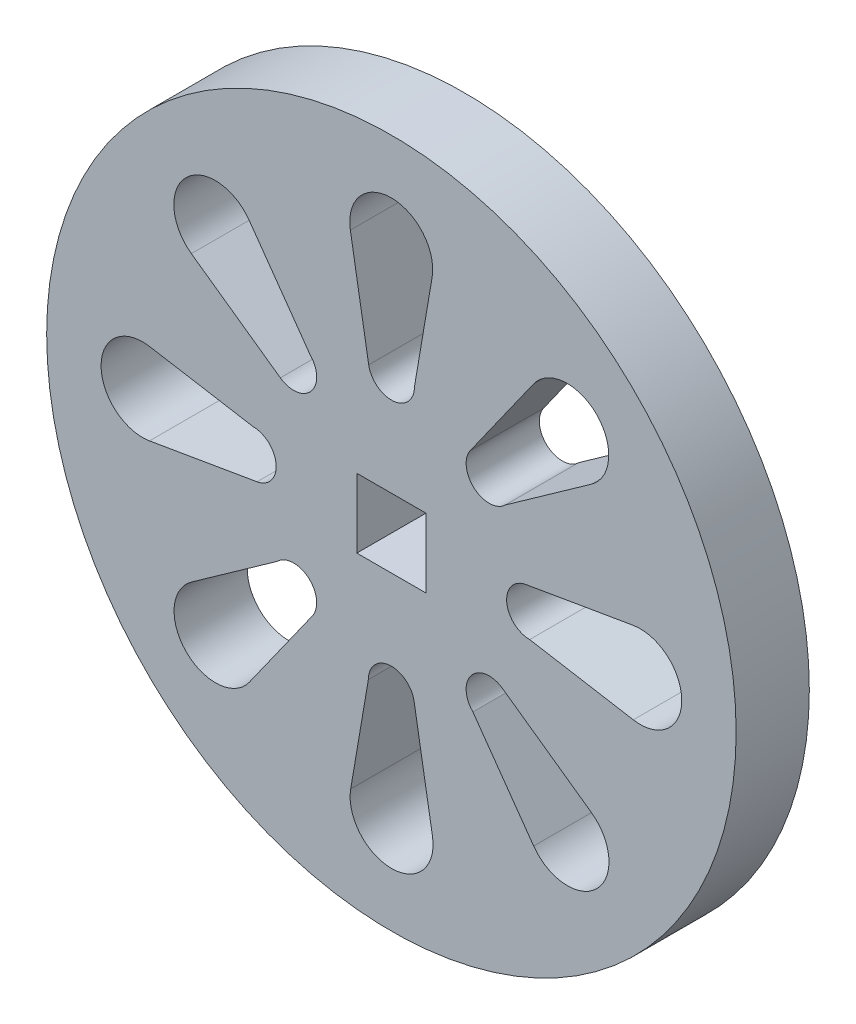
ISO-10303-21;
HEADER;
FILE_DESCRIPTION(('STEP AP214'),'2;1');
FILE_NAME('part.step','',(''),(''),'','','');
FILE_SCHEMA(('AUTOMOTIVE_DESIGN { 1 0 10303 214 1 1 1 1 }'));
ENDSEC;
DATA;
#1=APPLICATION_CONTEXT('core data for automotive mechanical design processes');
#2=APPLICATION_PROTOCOL_DEFINITION('international standard','automotive_design',2000,#1);
#3=PRODUCT_CONTEXT('',#1,'mechanical');
#4=PRODUCT('Part','Part','',(#3));
#5=PRODUCT_RELATED_PRODUCT_CATEGORY('part','',(#4));
#6=PRODUCT_DEFINITION_FORMATION('','',#4);
#7=PRODUCT_DEFINITION_CONTEXT('part definition',#1,'design');
#8=PRODUCT_DEFINITION('design','',#6,#7);
#9=PRODUCT_DEFINITION_SHAPE('','',#8);
#10=(LENGTH_UNIT() NAMED_UNIT(*) SI_UNIT(.MILLI.,.METRE.));
#11=(NAMED_UNIT(*) PLANE_ANGLE_UNIT() SI_UNIT($,.RADIAN.));
#12=(NAMED_UNIT(*) SI_UNIT($,.STERADIAN.) SOLID_ANGLE_UNIT());
#13=UNCERTAINTY_MEASURE_WITH_UNIT(LENGTH_MEASURE(1.E-05),#10,'distance_accuracy_value','');
#14=(GEOMETRIC_REPRESENTATION_CONTEXT(3) GLOBAL_UNCERTAINTY_ASSIGNED_CONTEXT((#13)) GLOBAL_UNIT_ASSIGNED_CONTEXT((#10,
#11,#12)) REPRESENTATION_CONTEXT('',''));
#15=CARTESIAN_POINT('',(0.,0.,0.));
#16=DIRECTION('',(0.,0.,1.));
#17=DIRECTION('',(1.,0.,0.));
#18=AXIS2_PLACEMENT_3D('',#15,#16,#17);
#19=CARTESIAN_POINT('',(0.,0.,10.0838));
#20=DIRECTION('',(0.,0.,-1.));
#21=DIRECTION('',(-1.,0.,0.));
#22=AXIS2_PLACEMENT_3D('',#19,#20,#21);
#23=CYLINDRICAL_SURFACE('',#22,47.5);
#24=CARTESIAN_POINT('',(0.,0.,10.0838));
#25=DIRECTION('',(0.,0.,1.));
#26=DIRECTION('',(1.,0.,0.));
#27=AXIS2_PLACEMENT_3D('',#24,#25,#26);
#28=CIRCLE('',#27,47.5);
#29=CARTESIAN_POINT('',(47.5,0.,10.0838));
#30=VERTEX_POINT('',#29);
#31=EDGE_CURVE('E12',#30,#30,#28,.T.);
#32=ORIENTED_EDGE('',*,*,#31,.F.);
#33=EDGE_LOOP('',(#32));
#34=FACE_BOUND('',#33,.T.);
#35=CARTESIAN_POINT('',(0.,0.,0.));
#36=DIRECTION('',(0.,0.,1.));
#37=DIRECTION('',(1.,0.,0.));
#38=AXIS2_PLACEMENT_3D('',#35,#36,#37);
#39=CIRCLE('',#38,47.5);
#40=CARTESIAN_POINT('',(47.5,0.,0.));
#41=VERTEX_POINT('',#40);
#42=EDGE_CURVE('E47',#41,#41,#39,.T.);
#43=ORIENTED_EDGE('',*,*,#42,.T.);
#44=EDGE_LOOP('',(#43));
#45=FACE_BOUND('',#44,.T.);
#46=ADVANCED_FACE('F44',(#34,#45),#23,.T.);
#47=CARTESIAN_POINT('',(0.,0.,10.0838));
#48=DIRECTION('',(0.,0.,1.));
#49=DIRECTION('',(1.,0.,0.));
#50=AXIS2_PLACEMENT_3D('',#47,#48,#49);
#51=PLANE('',#50);
#52=CARTESIAN_POINT('',(-34.289982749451,-0.0229302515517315,10.0838));
#53=DIRECTION('',(0.,0.,1.));
#54=DIRECTION('',(0.,-1.,0.));
#55=AXIS2_PLACEMENT_3D('',#52,#53,#54);
#56=CIRCLE('',#55,5.715);
#57=CARTESIAN_POINT('',(-33.3290052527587,5.61069622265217,10.0838));
#58=VERTEX_POINT('',#57);
#59=CARTESIAN_POINT('',(-33.3290052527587,-5.65655672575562,10.0838));
#60=VERTEX_POINT('',#59);
#61=EDGE_CURVE('E58',#58,#60,#56,.T.);
#62=ORIENTED_EDGE('',*,*,#61,.F.);
#63=DIRECTION('',(-0.985761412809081,0.168150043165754,0.));
#64=VECTOR('',#63,1.);
#65=CARTESIAN_POINT('',(-19.05,3.17499999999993,10.0838));
#66=LINE('',#65,#64);
#67=CARTESIAN_POINT('',(-19.05,3.17499999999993,10.0838));
#68=VERTEX_POINT('',#67);
#69=EDGE_CURVE('E1071',#68,#58,#66,.T.);
#70=ORIENTED_EDGE('',*,*,#69,.F.);
#71=CARTESIAN_POINT('',(-19.05,0.,10.0838));
#72=DIRECTION('',(0.,0.,1.));
#73=DIRECTION('',(0.,1.,0.));
#74=AXIS2_PLACEMENT_3D('',#71,#72,#73);
#75=CIRCLE('',#74,3.175);
#76=CARTESIAN_POINT('',(-18.5161236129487,-3.12979248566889,10.0838));
#77=VERTEX_POINT('',#76);
#78=EDGE_CURVE('E1114',#77,#68,#75,.T.);
#79=ORIENTED_EDGE('',*,*,#78,.F.);
#80=DIRECTION('',(0.98576141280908,0.168150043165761,0.));
#81=VECTOR('',#80,1.);
#82=CARTESIAN_POINT('',(-18.5161236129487,-3.1297924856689,10.0838));
#83=LINE('',#82,#81);
#84=EDGE_CURVE('E421',#60,#77,#83,.T.);
#85=ORIENTED_EDGE('',*,*,#84,.F.);
#86=EDGE_LOOP('',(#62,#70,#79,#85));
#87=FACE_BOUND('',#86,.T.);
#88=CARTESIAN_POINT('',(-24.2304651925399,-24.2628934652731,10.0838));
#89=DIRECTION('',(0.,0.,1.));
#90=DIRECTION('',(0.707106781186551,-0.707106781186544,0.));
#91=AXIS2_PLACEMENT_3D('',#88,#89,#90);
#92=CIRCLE('',#91,5.715);
#93=CARTESIAN_POINT('',(-27.5345269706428,-19.5998042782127,10.0838));
#94=VERTEX_POINT('',#93);
#95=CARTESIAN_POINT('',(-19.5673760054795,-27.5669552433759,10.0838));
#96=VERTEX_POINT('',#95);
#97=EDGE_CURVE('E66',#94,#96,#92,.T.);
#98=ORIENTED_EDGE('',*,*,#97,.F.);
#99=DIRECTION('',(-0.815938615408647,-0.578138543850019,0.));
#100=VECTOR('',#99,1.);
#101=CARTESIAN_POINT('',(-15.715448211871,-11.2253201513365,10.0838));
#102=LINE('',#101,#100);
#103=CARTESIAN_POINT('',(-15.715448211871,-11.2253201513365,10.0838));
#104=VERTEX_POINT('',#103);
#105=EDGE_CURVE('E1308',#104,#94,#102,.T.);
#106=ORIENTED_EDGE('',*,*,#105,.F.);
#107=CARTESIAN_POINT('',(-13.4703841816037,-13.4703841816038,10.0838));
#108=DIRECTION('',(0.,0.,1.));
#109=DIRECTION('',(-0.707106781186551,0.707106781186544,0.));
#110=AXIS2_PLACEMENT_3D('',#107,#108,#109);
#111=CIRCLE('',#110,3.175);
#112=CARTESIAN_POINT('',(-10.8797790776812,-15.3059740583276,10.0838));
#113=VERTEX_POINT('',#112);
#114=EDGE_CURVE('E399',#113,#104,#111,.T.);
#115=ORIENTED_EDGE('',*,*,#114,.F.);
#116=DIRECTION('',(0.57813854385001,0.815938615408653,0.));
#117=VECTOR('',#116,1.);
#118=CARTESIAN_POINT('',(-10.8797790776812,-15.3059740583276,10.0838));
#119=LINE('',#118,#117);
#120=EDGE_CURVE('E1247',#96,#113,#119,.T.);
#121=ORIENTED_EDGE('',*,*,#120,.F.);
#122=EDGE_LOOP('',(#98,#106,#115,#121));
#123=FACE_BOUND('',#122,.T.);
#124=CARTESIAN_POINT('',(0.0229302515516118,-34.289982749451,10.0838));
#125=DIRECTION('',(0.,0.,1.));
#126=DIRECTION('',(1.,0.,0.));
#127=AXIS2_PLACEMENT_3D('',#124,#125,#126);
#128=CIRCLE('',#127,5.715);
#129=CARTESIAN_POINT('',(-5.61069622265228,-33.3290052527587,10.0838));
#130=VERTEX_POINT('',#129);
#131=CARTESIAN_POINT('',(5.65655672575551,-33.3290052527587,10.0838));
#132=VERTEX_POINT('',#131);
#133=EDGE_CURVE('E1248',#130,#132,#128,.T.);
#134=ORIENTED_EDGE('',*,*,#133,.F.);
#135=DIRECTION('',(-0.168150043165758,-0.98576141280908,0.));
#136=VECTOR('',#135,1.);
#137=CARTESIAN_POINT('',(-3.175,-19.05,10.0838));
#138=LINE('',#137,#136);
#139=CARTESIAN_POINT('',(-3.175,-19.05,10.0838));
#140=VERTEX_POINT('',#139);
#141=EDGE_CURVE('E440',#140,#130,#138,.T.);
#142=ORIENTED_EDGE('',*,*,#141,.F.);
#143=CARTESIAN_POINT('',(0.,-19.05,10.0838));
#144=DIRECTION('',(0.,0.,1.));
#145=DIRECTION('',(-1.,0.,0.));
#146=AXIS2_PLACEMENT_3D('',#143,#144,#145);
#147=CIRCLE('',#146,3.175);
#148=CARTESIAN_POINT('',(3.12979248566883,-18.5161236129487,10.0838));
#149=VERTEX_POINT('',#148);
#150=EDGE_CURVE('E465',#149,#140,#147,.T.);
#151=ORIENTED_EDGE('',*,*,#150,.F.);
#152=DIRECTION('',(-0.168150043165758,0.98576141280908,0.));
#153=VECTOR('',#152,1.);
#154=CARTESIAN_POINT('',(3.12979248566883,-18.5161236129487,10.0838));
#155=LINE('',#154,#153);
#156=EDGE_CURVE('E424',#132,#149,#155,.T.);
#157=ORIENTED_EDGE('',*,*,#156,.F.);
#158=EDGE_LOOP('',(#134,#142,#151,#157));
#159=FACE_BOUND('',#158,.T.);
#160=CARTESIAN_POINT('',(24.2628934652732,-24.2304651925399,10.0838));
#161=DIRECTION('',(0.,0.,1.));
#162=DIRECTION('',(0.707106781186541,0.707106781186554,0.));
#163=AXIS2_PLACEMENT_3D('',#160,#161,#162);
#164=CIRCLE('',#163,5.715);
#165=CARTESIAN_POINT('',(19.5998042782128,-27.5345269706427,10.0838));
#166=VERTEX_POINT('',#165);
#167=CARTESIAN_POINT('',(27.566955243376,-19.5673760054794,10.0838));
#168=VERTEX_POINT('',#167);
#169=EDGE_CURVE('E1217',#166,#168,#164,.T.);
#170=ORIENTED_EDGE('',*,*,#169,.F.);
#171=DIRECTION('',(0.578138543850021,-0.815938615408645,0.));
#172=VECTOR('',#171,1.);
#173=CARTESIAN_POINT('',(11.2253201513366,-15.7154482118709,10.0838));
#174=LINE('',#173,#172);
#175=CARTESIAN_POINT('',(11.2253201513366,-15.7154482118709,10.0838));
#176=VERTEX_POINT('',#175);
#177=EDGE_CURVE('E1212',#176,#166,#174,.T.);
#178=ORIENTED_EDGE('',*,*,#177,.F.);
#179=CARTESIAN_POINT('',(13.4703841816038,-13.4703841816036,10.0838));
#180=DIRECTION('',(0.,0.,1.));
#181=DIRECTION('',(-0.707106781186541,-0.707106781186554,0.));
#182=AXIS2_PLACEMENT_3D('',#179,#180,#181);
#183=CIRCLE('',#182,3.175);
#184=CARTESIAN_POINT('',(15.3059740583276,-10.8797790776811,10.0838));
#185=VERTEX_POINT('',#184);
#186=EDGE_CURVE('E1201',#185,#176,#183,.T.);
#187=ORIENTED_EDGE('',*,*,#186,.F.);
#188=DIRECTION('',(-0.815938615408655,0.578138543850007,0.));
#189=VECTOR('',#188,1.);
#190=CARTESIAN_POINT('',(15.3059740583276,-10.8797790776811,10.0838));
#191=LINE('',#190,#189);
#192=EDGE_CURVE('E332',#168,#185,#191,.T.);
#193=ORIENTED_EDGE('',*,*,#192,.F.);
#194=EDGE_LOOP('',(#170,#178,#187,#193));
#195=FACE_BOUND('',#194,.T.);
#196=CARTESIAN_POINT('',(34.289982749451,0.0229302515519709,10.0838));
#197=DIRECTION('',(0.,0.,1.));
#198=DIRECTION('',(0.,1.,0.));
#199=AXIS2_PLACEMENT_3D('',#196,#197,#198);
#200=CIRCLE('',#199,5.715);
#201=CARTESIAN_POINT('',(33.3290052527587,-5.61069622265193,10.0838));
#202=VERTEX_POINT('',#201);
#203=CARTESIAN_POINT('',(33.3290052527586,5.65655672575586,10.0838));
#204=VERTEX_POINT('',#203);
#205=EDGE_CURVE('E321',#202,#204,#200,.T.);
#206=ORIENTED_EDGE('',*,*,#205,.F.);
#207=DIRECTION('',(0.985761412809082,-0.168150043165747,0.));
#208=VECTOR('',#207,1.);
#209=CARTESIAN_POINT('',(19.05,-3.1749999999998,10.0838));
#210=LINE('',#209,#208);
#211=CARTESIAN_POINT('',(19.05,-3.1749999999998,10.0838));
#212=VERTEX_POINT('',#211);
#213=EDGE_CURVE('E304',#212,#202,#210,.T.);
#214=ORIENTED_EDGE('',*,*,#213,.F.);
#215=CARTESIAN_POINT('',(19.05,1.99538158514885E-13,10.0838));
#216=DIRECTION('',(0.,0.,1.));
#217=DIRECTION('',(0.,-1.,0.));
#218=AXIS2_PLACEMENT_3D('',#215,#216,#217);
#219=CIRCLE('',#218,3.175);
#220=CARTESIAN_POINT('',(18.5161236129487,3.12979248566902,10.0838));
#221=VERTEX_POINT('',#220);
#222=EDGE_CURVE('E296',#221,#212,#219,.T.);
#223=ORIENTED_EDGE('',*,*,#222,.F.);
#224=DIRECTION('',(-0.985761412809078,-0.168150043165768,0.));
#225=VECTOR('',#224,1.);
#226=CARTESIAN_POINT('',(18.5161236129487,3.12979248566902,10.0838));
#227=LINE('',#226,#225);
#228=EDGE_CURVE('E281',#204,#221,#227,.T.);
#229=ORIENTED_EDGE('',*,*,#228,.F.);
#230=EDGE_LOOP('',(#206,#214,#223,#229));
#231=FACE_BOUND('',#230,.T.);
#232=CARTESIAN_POINT('',(24.2304651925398,24.2628934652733,10.0838));
#233=DIRECTION('',(0.,0.,1.));
#234=DIRECTION('',(-0.707106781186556,0.707106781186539,0.));
#235=AXIS2_PLACEMENT_3D('',#232,#233,#234);
#236=CIRCLE('',#235,5.715);
#237=CARTESIAN_POINT('',(27.5345269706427,19.5998042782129,10.0838));
#238=VERTEX_POINT('',#237);
#239=CARTESIAN_POINT('',(19.5673760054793,27.5669552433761,10.0838));
#240=VERTEX_POINT('',#239);
#241=EDGE_CURVE('E1142',#238,#240,#236,.T.);
#242=ORIENTED_EDGE('',*,*,#241,.F.);
#243=DIRECTION('',(0.815938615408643,0.578138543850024,0.));
#244=VECTOR('',#243,1.);
#245=CARTESIAN_POINT('',(15.7154482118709,11.2253201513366,10.0838));
#246=LINE('',#245,#244);
#247=CARTESIAN_POINT('',(15.7154482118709,11.2253201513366,10.0838));
#248=VERTEX_POINT('',#247);
#249=EDGE_CURVE('E1147',#248,#238,#246,.T.);
#250=ORIENTED_EDGE('',*,*,#249,.F.);
#251=CARTESIAN_POINT('',(13.4703841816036,13.4703841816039,10.0838));
#252=DIRECTION('',(0.,0.,1.));
#253=DIRECTION('',(0.707106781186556,-0.707106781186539,0.));
#254=AXIS2_PLACEMENT_3D('',#251,#252,#253);
#255=CIRCLE('',#254,3.175);
#256=CARTESIAN_POINT('',(10.8797790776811,15.3059740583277,10.0838));
#257=VERTEX_POINT('',#256);
#258=EDGE_CURVE('E1171',#257,#248,#255,.T.);
#259=ORIENTED_EDGE('',*,*,#258,.F.);
#260=DIRECTION('',(-0.578138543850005,-0.815938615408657,0.));
#261=VECTOR('',#260,1.);
#262=CARTESIAN_POINT('',(10.8797790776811,15.3059740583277,10.0838));
#263=LINE('',#262,#261);
#264=EDGE_CURVE('E333',#240,#257,#263,.T.);
#265=ORIENTED_EDGE('',*,*,#264,.F.);
#266=EDGE_LOOP('',(#242,#250,#259,#265));
#267=FACE_BOUND('',#266,.T.);
#268=CARTESIAN_POINT('',(-24.262893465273,24.23046519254,10.0838));
#269=DIRECTION('',(0.,0.,1.));
#270=DIRECTION('',(-0.707106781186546,-0.707106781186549,0.));
#271=AXIS2_PLACEMENT_3D('',#268,#269,#270);
#272=CIRCLE('',#271,5.715);
#273=CARTESIAN_POINT('',(-19.5998042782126,27.5345269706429,10.0838));
#274=VERTEX_POINT('',#273);
#275=CARTESIAN_POINT('',(-27.5669552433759,19.5673760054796,10.0838));
#276=VERTEX_POINT('',#275);
#277=EDGE_CURVE('E480',#274,#276,#272,.T.);
#278=ORIENTED_EDGE('',*,*,#277,.F.);
#279=DIRECTION('',(-0.578138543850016,0.815938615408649,0.));
#280=VECTOR('',#279,1.);
#281=CARTESIAN_POINT('',(-11.2253201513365,15.715448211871,10.0838));
#282=LINE('',#281,#280);
#283=CARTESIAN_POINT('',(-11.2253201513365,15.715448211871,10.0838));
#284=VERTEX_POINT('',#283);
#285=EDGE_CURVE('E526',#284,#274,#282,.T.);
#286=ORIENTED_EDGE('',*,*,#285,.F.);
#287=CARTESIAN_POINT('',(-13.4703841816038,13.4703841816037,10.0838));
#288=DIRECTION('',(0.,0.,1.));
#289=DIRECTION('',(0.707106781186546,0.707106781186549,0.));
#290=AXIS2_PLACEMENT_3D('',#287,#288,#289);
#291=CIRCLE('',#290,3.175);
#292=CARTESIAN_POINT('',(-15.3059740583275,10.8797790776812,10.0838));
#293=VERTEX_POINT('',#292);
#294=EDGE_CURVE('E514',#293,#284,#291,.T.);
#295=ORIENTED_EDGE('',*,*,#294,.F.);
#296=DIRECTION('',(0.815938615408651,-0.578138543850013,0.));
#297=VECTOR('',#296,1.);
#298=CARTESIAN_POINT('',(-15.3059740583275,10.8797790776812,10.0838));
#299=LINE('',#298,#297);
#300=EDGE_CURVE('E497',#276,#293,#299,.T.);
#301=ORIENTED_EDGE('',*,*,#300,.F.);
#302=EDGE_LOOP('',(#278,#286,#295,#301));
#303=FACE_BOUND('',#302,.T.);
#304=CARTESIAN_POINT('',(-0.0229302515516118,34.289982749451,10.0838));
#305=DIRECTION('',(0.,0.,1.));
#306=DIRECTION('',(-1.,0.,0.));
#307=AXIS2_PLACEMENT_3D('',#304,#305,#306);
#308=CIRCLE('',#307,5.715);
#309=CARTESIAN_POINT('',(5.61069622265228,33.3290052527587,10.0838));
#310=VERTEX_POINT('',#309);
#311=CARTESIAN_POINT('',(-5.65655672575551,33.3290052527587,10.0838));
#312=VERTEX_POINT('',#311);
#313=EDGE_CURVE('E550',#310,#312,#308,.T.);
#314=ORIENTED_EDGE('',*,*,#313,.F.);
#315=DIRECTION('',(0.168150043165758,0.98576141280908,0.));
#316=VECTOR('',#315,1.);
#317=CARTESIAN_POINT('',(3.175,19.05,10.0838));
#318=LINE('',#317,#316);
#319=CARTESIAN_POINT('',(3.175,19.05,10.0838));
#320=VERTEX_POINT('',#319);
#321=EDGE_CURVE('E378',#320,#310,#318,.T.);
#322=ORIENTED_EDGE('',*,*,#321,.F.);
#323=CARTESIAN_POINT('',(0.,19.05,10.0838));
#324=DIRECTION('',(0.,0.,1.));
#325=DIRECTION('',(1.,0.,0.));
#326=AXIS2_PLACEMENT_3D('',#323,#324,#325);
#327=CIRCLE('',#326,3.175);
#328=CARTESIAN_POINT('',(-3.12979248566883,18.5161236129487,10.0838));
#329=VERTEX_POINT('',#328);
#330=EDGE_CURVE('E557',#329,#320,#327,.T.);
#331=ORIENTED_EDGE('',*,*,#330,.F.);
#332=DIRECTION('',(0.168150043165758,-0.98576141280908,0.));
#333=VECTOR('',#332,1.);
#334=CARTESIAN_POINT('',(-3.12979248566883,18.5161236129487,10.0838));
#335=LINE('',#334,#333);
#336=EDGE_CURVE('E551',#312,#329,#335,.T.);
#337=ORIENTED_EDGE('',*,*,#336,.F.);
#338=EDGE_LOOP('',(#314,#322,#331,#337));
#339=FACE_BOUND('',#338,.T.);
#340=DIRECTION('',(0.,1.,0.));
#341=VECTOR('',#340,1.);
#342=CARTESIAN_POINT('',(4.7625,4.7625,10.0838));
#343=LINE('',#342,#341);
#344=CARTESIAN_POINT('',(4.7625,-4.7625,10.0838));
#345=VERTEX_POINT('',#344);
#346=CARTESIAN_POINT('',(4.7625,4.7625,10.0838));
#347=VERTEX_POINT('',#346);
#348=EDGE_CURVE('E376',#345,#347,#343,.T.);
#349=ORIENTED_EDGE('',*,*,#348,.F.);
#350=DIRECTION('',(1.,0.,0.));
#351=VECTOR('',#350,1.);
#352=CARTESIAN_POINT('',(-4.7625,-4.7625,10.0838));
#353=LINE('',#352,#351);
#354=CARTESIAN_POINT('',(-4.7625,-4.7625,10.0838));
#355=VERTEX_POINT('',#354);
#356=EDGE_CURVE('E357',#355,#345,#353,.T.);
#357=ORIENTED_EDGE('',*,*,#356,.F.);
#358=DIRECTION('',(0.,-1.,0.));
#359=VECTOR('',#358,1.);
#360=CARTESIAN_POINT('',(-4.7625,4.7625,10.0838));
#361=LINE('',#360,#359);
#362=CARTESIAN_POINT('',(-4.7625,4.7625,10.0838));
#363=VERTEX_POINT('',#362);
#364=EDGE_CURVE('E658',#363,#355,#361,.T.);
#365=ORIENTED_EDGE('',*,*,#364,.F.);
#366=DIRECTION('',(-1.,0.,0.));
#367=VECTOR('',#366,1.);
#368=CARTESIAN_POINT('',(-4.7625,4.7625,10.0838));
#369=LINE('',#368,#367);
#370=EDGE_CURVE('E662',#347,#363,#369,.T.);
#371=ORIENTED_EDGE('',*,*,#370,.F.);
#372=EDGE_LOOP('',(#349,#357,#365,#371));
#373=FACE_BOUND('',#372,.T.);
#374=ORIENTED_EDGE('',*,*,#31,.T.);
#375=EDGE_LOOP('',(#374));
#376=FACE_BOUND('',#375,.T.);
#377=ADVANCED_FACE('F302',(#87,#123,#159,#195,#231,#267,#303,#339,#373,#376),#51,.T.);
#378=CARTESIAN_POINT('',(0.,0.,0.));
#379=DIRECTION('',(0.,0.,1.));
#380=DIRECTION('',(1.,0.,0.));
#381=AXIS2_PLACEMENT_3D('',#378,#379,#380);
#382=PLANE('',#381);
#383=DIRECTION('',(-0.985761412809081,0.168150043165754,0.));
#384=VECTOR('',#383,1.);
#385=CARTESIAN_POINT('',(-19.05,3.17499999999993,0.));
#386=LINE('',#385,#384);
#387=CARTESIAN_POINT('',(-19.05,3.17499999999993,0.));
#388=VERTEX_POINT('',#387);
#389=CARTESIAN_POINT('',(-33.3290052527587,5.61069622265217,0.));
#390=VERTEX_POINT('',#389);
#391=EDGE_CURVE('E1064',#388,#390,#386,.T.);
#392=ORIENTED_EDGE('',*,*,#391,.T.);
#393=CARTESIAN_POINT('',(-34.289982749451,-0.0229302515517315,0.));
#394=DIRECTION('',(0.,0.,1.));
#395=DIRECTION('',(0.,-1.,0.));
#396=AXIS2_PLACEMENT_3D('',#393,#394,#395);
#397=CIRCLE('',#396,5.715);
#398=CARTESIAN_POINT('',(-33.3290052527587,-5.65655672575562,0.));
#399=VERTEX_POINT('',#398);
#400=EDGE_CURVE('E502',#390,#399,#397,.T.);
#401=ORIENTED_EDGE('',*,*,#400,.T.);
#402=DIRECTION('',(0.98576141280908,0.168150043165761,0.));
#403=VECTOR('',#402,1.);
#404=CARTESIAN_POINT('',(-18.5161236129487,-3.1297924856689,0.));
#405=LINE('',#404,#403);
#406=CARTESIAN_POINT('',(-18.5161236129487,-3.1297924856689,0.));
#407=VERTEX_POINT('',#406);
#408=EDGE_CURVE('E1091',#399,#407,#405,.T.);
#409=ORIENTED_EDGE('',*,*,#408,.T.);
#410=CARTESIAN_POINT('',(-19.05,0.,0.));
#411=DIRECTION('',(0.,0.,1.));
#412=DIRECTION('',(0.,1.,0.));
#413=AXIS2_PLACEMENT_3D('',#410,#411,#412);
#414=CIRCLE('',#413,3.175);
#415=EDGE_CURVE('E1102',#407,#388,#414,.T.);
#416=ORIENTED_EDGE('',*,*,#415,.T.);
#417=EDGE_LOOP('',(#392,#401,#409,#416));
#418=FACE_BOUND('',#417,.T.);
#419=DIRECTION('',(-0.815938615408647,-0.578138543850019,0.));
#420=VECTOR('',#419,1.);
#421=CARTESIAN_POINT('',(-15.715448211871,-11.2253201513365,0.));
#422=LINE('',#421,#420);
#423=CARTESIAN_POINT('',(-15.715448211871,-11.2253201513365,0.));
#424=VERTEX_POINT('',#423);
#425=CARTESIAN_POINT('',(-27.5345269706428,-19.5998042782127,0.));
#426=VERTEX_POINT('',#425);
#427=EDGE_CURVE('E1302',#424,#426,#422,.T.);
#428=ORIENTED_EDGE('',*,*,#427,.T.);
#429=CARTESIAN_POINT('',(-24.2304651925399,-24.2628934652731,0.));
#430=DIRECTION('',(0.,0.,1.));
#431=DIRECTION('',(0.707106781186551,-0.707106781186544,0.));
#432=AXIS2_PLACEMENT_3D('',#429,#430,#431);
#433=CIRCLE('',#432,5.715);
#434=CARTESIAN_POINT('',(-19.5673760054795,-27.5669552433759,0.));
#435=VERTEX_POINT('',#434);
#436=EDGE_CURVE('E417',#426,#435,#433,.T.);
#437=ORIENTED_EDGE('',*,*,#436,.T.);
#438=DIRECTION('',(0.57813854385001,0.815938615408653,0.));
#439=VECTOR('',#438,1.);
#440=CARTESIAN_POINT('',(-10.8797790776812,-15.3059740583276,0.));
#441=LINE('',#440,#439);
#442=CARTESIAN_POINT('',(-10.8797790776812,-15.3059740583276,0.));
#443=VERTEX_POINT('',#442);
#444=EDGE_CURVE('E1324',#435,#443,#441,.T.);
#445=ORIENTED_EDGE('',*,*,#444,.T.);
#446=CARTESIAN_POINT('',(-13.4703841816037,-13.4703841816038,0.));
#447=DIRECTION('',(0.,0.,1.));
#448=DIRECTION('',(-0.707106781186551,0.707106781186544,0.));
#449=AXIS2_PLACEMENT_3D('',#446,#447,#448);
#450=CIRCLE('',#449,3.175);
#451=EDGE_CURVE('E1314',#443,#424,#450,.T.);
#452=ORIENTED_EDGE('',*,*,#451,.T.);
#453=EDGE_LOOP('',(#428,#437,#445,#452));
#454=FACE_BOUND('',#453,.T.);
#455=DIRECTION('',(-0.168150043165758,-0.98576141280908,0.));
#456=VECTOR('',#455,1.);
#457=CARTESIAN_POINT('',(-3.175,-19.05,0.));
#458=LINE('',#457,#456);
#459=CARTESIAN_POINT('',(-3.175,-19.05,0.));
#460=VERTEX_POINT('',#459);
#461=CARTESIAN_POINT('',(-5.61069622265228,-33.3290052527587,0.));
#462=VERTEX_POINT('',#461);
#463=EDGE_CURVE('E451',#460,#462,#458,.T.);
#464=ORIENTED_EDGE('',*,*,#463,.T.);
#465=CARTESIAN_POINT('',(0.0229302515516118,-34.289982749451,0.));
#466=DIRECTION('',(0.,0.,1.));
#467=DIRECTION('',(1.,0.,0.));
#468=AXIS2_PLACEMENT_3D('',#465,#466,#467);
#469=CIRCLE('',#468,5.715);
#470=CARTESIAN_POINT('',(5.65655672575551,-33.3290052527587,0.));
#471=VERTEX_POINT('',#470);
#472=EDGE_CURVE('E1244',#462,#471,#469,.T.);
#473=ORIENTED_EDGE('',*,*,#472,.T.);
#474=DIRECTION('',(-0.168150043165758,0.98576141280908,0.));
#475=VECTOR('',#474,1.);
#476=CARTESIAN_POINT('',(3.12979248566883,-18.5161236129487,0.));
#477=LINE('',#476,#475);
#478=CARTESIAN_POINT('',(3.12979248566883,-18.5161236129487,0.));
#479=VERTEX_POINT('',#478);
#480=EDGE_CURVE('E427',#471,#479,#477,.T.);
#481=ORIENTED_EDGE('',*,*,#480,.T.);
#482=CARTESIAN_POINT('',(0.,-19.05,0.));
#483=DIRECTION('',(0.,0.,1.));
#484=DIRECTION('',(-1.,0.,0.));
#485=AXIS2_PLACEMENT_3D('',#482,#483,#484);
#486=CIRCLE('',#485,3.175);
#487=EDGE_CURVE('E445',#479,#460,#486,.T.);
#488=ORIENTED_EDGE('',*,*,#487,.T.);
#489=EDGE_LOOP('',(#464,#473,#481,#488));
#490=FACE_BOUND('',#489,.T.);
#491=DIRECTION('',(0.578138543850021,-0.815938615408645,0.));
#492=VECTOR('',#491,1.);
#493=CARTESIAN_POINT('',(11.2253201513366,-15.7154482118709,0.));
#494=LINE('',#493,#492);
#495=CARTESIAN_POINT('',(11.2253201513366,-15.7154482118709,0.));
#496=VERTEX_POINT('',#495);
#497=CARTESIAN_POINT('',(19.5998042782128,-27.5345269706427,0.));
#498=VERTEX_POINT('',#497);
#499=EDGE_CURVE('E1211',#496,#498,#494,.T.);
#500=ORIENTED_EDGE('',*,*,#499,.T.);
#501=CARTESIAN_POINT('',(24.2628934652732,-24.2304651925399,0.));
#502=DIRECTION('',(0.,0.,1.));
#503=DIRECTION('',(0.707106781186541,0.707106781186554,0.));
#504=AXIS2_PLACEMENT_3D('',#501,#502,#503);
#505=CIRCLE('',#504,5.715);
#506=CARTESIAN_POINT('',(27.566955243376,-19.5673760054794,0.));
#507=VERTEX_POINT('',#506);
#508=EDGE_CURVE('E428',#498,#507,#505,.T.);
#509=ORIENTED_EDGE('',*,*,#508,.T.);
#510=DIRECTION('',(-0.815938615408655,0.578138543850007,0.));
#511=VECTOR('',#510,1.);
#512=CARTESIAN_POINT('',(15.3059740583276,-10.8797790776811,0.));
#513=LINE('',#512,#511);
#514=CARTESIAN_POINT('',(15.3059740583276,-10.8797790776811,0.));
#515=VERTEX_POINT('',#514);
#516=EDGE_CURVE('E1195',#507,#515,#513,.T.);
#517=ORIENTED_EDGE('',*,*,#516,.T.);
#518=CARTESIAN_POINT('',(13.4703841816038,-13.4703841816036,0.));
#519=DIRECTION('',(0.,0.,1.));
#520=DIRECTION('',(-0.707106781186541,-0.707106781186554,0.));
#521=AXIS2_PLACEMENT_3D('',#518,#519,#520);
#522=CIRCLE('',#521,3.175);
#523=EDGE_CURVE('E1225',#515,#496,#522,.T.);
#524=ORIENTED_EDGE('',*,*,#523,.T.);
#525=EDGE_LOOP('',(#500,#509,#517,#524));
#526=FACE_BOUND('',#525,.T.);
#527=DIRECTION('',(0.985761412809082,-0.168150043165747,0.));
#528=VECTOR('',#527,1.);
#529=CARTESIAN_POINT('',(19.05,-3.1749999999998,0.));
#530=LINE('',#529,#528);
#531=CARTESIAN_POINT('',(19.05,-3.1749999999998,0.));
#532=VERTEX_POINT('',#531);
#533=CARTESIAN_POINT('',(33.3290052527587,-5.61069622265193,0.));
#534=VERTEX_POINT('',#533);
#535=EDGE_CURVE('E326',#532,#534,#530,.T.);
#536=ORIENTED_EDGE('',*,*,#535,.T.);
#537=CARTESIAN_POINT('',(34.289982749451,0.0229302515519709,0.));
#538=DIRECTION('',(0.,0.,1.));
#539=DIRECTION('',(0.,1.,0.));
#540=AXIS2_PLACEMENT_3D('',#537,#538,#539);
#541=CIRCLE('',#540,5.715);
#542=CARTESIAN_POINT('',(33.3290052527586,5.65655672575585,0.));
#543=VERTEX_POINT('',#542);
#544=EDGE_CURVE('E325',#534,#543,#541,.T.);
#545=ORIENTED_EDGE('',*,*,#544,.T.);
#546=DIRECTION('',(-0.985761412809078,-0.168150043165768,0.));
#547=VECTOR('',#546,1.);
#548=CARTESIAN_POINT('',(18.5161236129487,3.12979248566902,0.));
#549=LINE('',#548,#547);
#550=CARTESIAN_POINT('',(18.5161236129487,3.12979248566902,0.));
#551=VERTEX_POINT('',#550);
#552=EDGE_CURVE('E291',#543,#551,#549,.T.);
#553=ORIENTED_EDGE('',*,*,#552,.T.);
#554=CARTESIAN_POINT('',(19.05,1.99538158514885E-13,0.));
#555=DIRECTION('',(0.,0.,1.));
#556=DIRECTION('',(0.,-1.,0.));
#557=AXIS2_PLACEMENT_3D('',#554,#555,#556);
#558=CIRCLE('',#557,3.175);
#559=EDGE_CURVE('E299',#551,#532,#558,.T.);
#560=ORIENTED_EDGE('',*,*,#559,.T.);
#561=EDGE_LOOP('',(#536,#545,#553,#560));
#562=FACE_BOUND('',#561,.T.);
#563=DIRECTION('',(0.815938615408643,0.578138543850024,0.));
#564=VECTOR('',#563,1.);
#565=CARTESIAN_POINT('',(15.7154482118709,11.2253201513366,0.));
#566=LINE('',#565,#564);
#567=CARTESIAN_POINT('',(15.7154482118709,11.2253201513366,0.));
#568=VERTEX_POINT('',#567);
#569=CARTESIAN_POINT('',(27.5345269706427,19.5998042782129,0.));
#570=VERTEX_POINT('',#569);
#571=EDGE_CURVE('E1137',#568,#570,#566,.T.);
#572=ORIENTED_EDGE('',*,*,#571,.T.);
#573=CARTESIAN_POINT('',(24.2304651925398,24.2628934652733,0.));
#574=DIRECTION('',(0.,0.,1.));
#575=DIRECTION('',(-0.707106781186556,0.707106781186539,0.));
#576=AXIS2_PLACEMENT_3D('',#573,#574,#575);
#577=CIRCLE('',#576,5.715);
#578=CARTESIAN_POINT('',(19.5673760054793,27.5669552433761,0.));
#579=VERTEX_POINT('',#578);
#580=EDGE_CURVE('E292',#570,#579,#577,.T.);
#581=ORIENTED_EDGE('',*,*,#580,.T.);
#582=DIRECTION('',(-0.578138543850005,-0.815938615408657,0.));
#583=VECTOR('',#582,1.);
#584=CARTESIAN_POINT('',(10.8797790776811,15.3059740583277,0.));
#585=LINE('',#584,#583);
#586=CARTESIAN_POINT('',(10.8797790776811,15.3059740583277,0.));
#587=VERTEX_POINT('',#586);
#588=EDGE_CURVE('E1174',#579,#587,#585,.T.);
#589=ORIENTED_EDGE('',*,*,#588,.T.);
#590=CARTESIAN_POINT('',(13.4703841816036,13.4703841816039,0.));
#591=DIRECTION('',(0.,0.,1.));
#592=DIRECTION('',(0.707106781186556,-0.707106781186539,0.));
#593=AXIS2_PLACEMENT_3D('',#590,#591,#592);
#594=CIRCLE('',#593,3.175);
#595=EDGE_CURVE('E1140',#587,#568,#594,.T.);
#596=ORIENTED_EDGE('',*,*,#595,.T.);
#597=EDGE_LOOP('',(#572,#581,#589,#596));
#598=FACE_BOUND('',#597,.T.);
#599=DIRECTION('',(-0.578138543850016,0.815938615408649,0.));
#600=VECTOR('',#599,1.);
#601=CARTESIAN_POINT('',(-11.2253201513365,15.715448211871,0.));
#602=LINE('',#601,#600);
#603=CARTESIAN_POINT('',(-11.2253201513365,15.715448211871,0.));
#604=VERTEX_POINT('',#603);
#605=CARTESIAN_POINT('',(-19.5998042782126,27.5345269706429,0.));
#606=VERTEX_POINT('',#605);
#607=EDGE_CURVE('E474',#604,#606,#602,.T.);
#608=ORIENTED_EDGE('',*,*,#607,.T.);
#609=CARTESIAN_POINT('',(-24.262893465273,24.23046519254,0.));
#610=DIRECTION('',(0.,0.,1.));
#611=DIRECTION('',(-0.707106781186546,-0.707106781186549,0.));
#612=AXIS2_PLACEMENT_3D('',#609,#610,#611);
#613=CIRCLE('',#612,5.715);
#614=CARTESIAN_POINT('',(-27.5669552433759,19.5673760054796,0.));
#615=VERTEX_POINT('',#614);
#616=EDGE_CURVE('E486',#606,#615,#613,.T.);
#617=ORIENTED_EDGE('',*,*,#616,.T.);
#618=DIRECTION('',(0.815938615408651,-0.578138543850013,0.));
#619=VECTOR('',#618,1.);
#620=CARTESIAN_POINT('',(-15.3059740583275,10.8797790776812,0.));
#621=LINE('',#620,#619);
#622=CARTESIAN_POINT('',(-15.3059740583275,10.8797790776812,0.));
#623=VERTEX_POINT('',#622);
#624=EDGE_CURVE('E501',#615,#623,#621,.T.);
#625=ORIENTED_EDGE('',*,*,#624,.T.);
#626=CARTESIAN_POINT('',(-13.4703841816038,13.4703841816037,0.));
#627=DIRECTION('',(0.,0.,1.));
#628=DIRECTION('',(0.707106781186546,0.707106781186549,0.));
#629=AXIS2_PLACEMENT_3D('',#626,#627,#628);
#630=CIRCLE('',#629,3.175);
#631=EDGE_CURVE('E523',#623,#604,#630,.T.);
#632=ORIENTED_EDGE('',*,*,#631,.T.);
#633=EDGE_LOOP('',(#608,#617,#625,#632));
#634=FACE_BOUND('',#633,.T.);
#635=DIRECTION('',(0.168150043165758,0.98576141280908,0.));
#636=VECTOR('',#635,1.);
#637=CARTESIAN_POINT('',(3.175,19.05,0.));
#638=LINE('',#637,#636);
#639=CARTESIAN_POINT('',(3.175,19.05,0.));
#640=VERTEX_POINT('',#639);
#641=CARTESIAN_POINT('',(5.61069622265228,33.3290052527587,0.));
#642=VERTEX_POINT('',#641);
#643=EDGE_CURVE('E561',#640,#642,#638,.T.);
#644=ORIENTED_EDGE('',*,*,#643,.T.);
#645=CARTESIAN_POINT('',(-0.0229302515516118,34.289982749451,0.));
#646=DIRECTION('',(0.,0.,1.));
#647=DIRECTION('',(-1.,0.,0.));
#648=AXIS2_PLACEMENT_3D('',#645,#646,#647);
#649=CIRCLE('',#648,5.715);
#650=CARTESIAN_POINT('',(-5.65655672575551,33.3290052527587,0.));
#651=VERTEX_POINT('',#650);
#652=EDGE_CURVE('E574',#642,#651,#649,.T.);
#653=ORIENTED_EDGE('',*,*,#652,.T.);
#654=DIRECTION('',(0.168150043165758,-0.98576141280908,0.));
#655=VECTOR('',#654,1.);
#656=CARTESIAN_POINT('',(-3.12979248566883,18.5161236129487,0.));
#657=LINE('',#656,#655);
#658=CARTESIAN_POINT('',(-3.12979248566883,18.5161236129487,0.));
#659=VERTEX_POINT('',#658);
#660=EDGE_CURVE('E577',#651,#659,#657,.T.);
#661=ORIENTED_EDGE('',*,*,#660,.T.);
#662=CARTESIAN_POINT('',(0.,19.05,0.));
#663=DIRECTION('',(0.,0.,1.));
#664=DIRECTION('',(1.,0.,0.));
#665=AXIS2_PLACEMENT_3D('',#662,#663,#664);
#666=CIRCLE('',#665,3.175);
#667=EDGE_CURVE('E580',#659,#640,#666,.T.);
#668=ORIENTED_EDGE('',*,*,#667,.T.);
#669=EDGE_LOOP('',(#644,#653,#661,#668));
#670=FACE_BOUND('',#669,.T.);
#671=DIRECTION('',(1.,0.,0.));
#672=VECTOR('',#671,1.);
#673=CARTESIAN_POINT('',(-4.7625,-4.7625,0.));
#674=LINE('',#673,#672);
#675=CARTESIAN_POINT('',(-4.7625,-4.7625,0.));
#676=VERTEX_POINT('',#675);
#677=CARTESIAN_POINT('',(4.7625,-4.7625,0.));
#678=VERTEX_POINT('',#677);
#679=EDGE_CURVE('E668',#676,#678,#674,.T.);
#680=ORIENTED_EDGE('',*,*,#679,.T.);
#681=DIRECTION('',(0.,1.,0.));
#682=VECTOR('',#681,1.);
#683=CARTESIAN_POINT('',(4.7625,4.7625,0.));
#684=LINE('',#683,#682);
#685=CARTESIAN_POINT('',(4.7625,4.7625,0.));
#686=VERTEX_POINT('',#685);
#687=EDGE_CURVE('E657',#678,#686,#684,.T.);
#688=ORIENTED_EDGE('',*,*,#687,.T.);
#689=DIRECTION('',(-1.,0.,0.));
#690=VECTOR('',#689,1.);
#691=CARTESIAN_POINT('',(-4.7625,4.7625,0.));
#692=LINE('',#691,#690);
#693=CARTESIAN_POINT('',(-4.7625,4.7625,0.));
#694=VERTEX_POINT('',#693);
#695=EDGE_CURVE('E683',#686,#694,#692,.T.);
#696=ORIENTED_EDGE('',*,*,#695,.T.);
#697=DIRECTION('',(0.,-1.,0.));
#698=VECTOR('',#697,1.);
#699=CARTESIAN_POINT('',(-4.7625,4.7625,0.));
#700=LINE('',#699,#698);
#701=EDGE_CURVE('E680',#694,#676,#700,.T.);
#702=ORIENTED_EDGE('',*,*,#701,.T.);
#703=EDGE_LOOP('',(#680,#688,#696,#702));
#704=FACE_BOUND('',#703,.T.);
#705=ORIENTED_EDGE('',*,*,#42,.F.);
#706=EDGE_LOOP('',(#705));
#707=FACE_BOUND('',#706,.T.);
#708=ADVANCED_FACE('F548',(#418,#454,#490,#526,#562,#598,#634,#670,#704,#707),#382,.F.);
#709=CARTESIAN_POINT('',(4.7625,4.7625,0.));
#710=DIRECTION('',(1.,0.,0.));
#711=DIRECTION('',(0.,1.,0.));
#712=AXIS2_PLACEMENT_3D('',#709,#710,#711);
#713=PLANE('',#712);
#714=ORIENTED_EDGE('',*,*,#348,.T.);
#715=DIRECTION('',(0.,0.,1.));
#716=VECTOR('',#715,1.);
#717=CARTESIAN_POINT('',(4.7625,4.7625,0.));
#718=LINE('',#717,#716);
#719=EDGE_CURVE('E365',#686,#347,#718,.T.);
#720=ORIENTED_EDGE('',*,*,#719,.F.);
#721=ORIENTED_EDGE('',*,*,#687,.F.);
#722=DIRECTION('',(0.,0.,1.));
#723=VECTOR('',#722,1.);
#724=CARTESIAN_POINT('',(4.7625,-4.7625,0.));
#725=LINE('',#724,#723);
#726=EDGE_CURVE('E353',#678,#345,#725,.T.);
#727=ORIENTED_EDGE('',*,*,#726,.T.);
#728=EDGE_LOOP('',(#714,#720,#721,#727));
#729=FACE_BOUND('',#728,.T.);
#730=ADVANCED_FACE('F633',(#729),#713,.F.);
#731=CARTESIAN_POINT('',(-4.7625,-4.7625,0.));
#732=DIRECTION('',(0.,-1.,0.));
#733=DIRECTION('',(0.,0.,-1.));
#734=AXIS2_PLACEMENT_3D('',#731,#732,#733);
#735=PLANE('',#734);
#736=ORIENTED_EDGE('',*,*,#356,.T.);
#737=ORIENTED_EDGE('',*,*,#726,.F.);
#738=ORIENTED_EDGE('',*,*,#679,.F.);
#739=DIRECTION('',(0.,0.,1.));
#740=VECTOR('',#739,1.);
#741=CARTESIAN_POINT('',(-4.7625,-4.7625,0.));
#742=LINE('',#741,#740);
#743=EDGE_CURVE('E356',#676,#355,#742,.T.);
#744=ORIENTED_EDGE('',*,*,#743,.T.);
#745=EDGE_LOOP('',(#736,#737,#738,#744));
#746=FACE_BOUND('',#745,.T.);
#747=ADVANCED_FACE('F638',(#746),#735,.F.);
#748=CARTESIAN_POINT('',(-4.7625,4.7625,0.));
#749=DIRECTION('',(-1.,0.,0.));
#750=DIRECTION('',(0.,-1.,0.));
#751=AXIS2_PLACEMENT_3D('',#748,#749,#750);
#752=PLANE('',#751);
#753=ORIENTED_EDGE('',*,*,#364,.T.);
#754=ORIENTED_EDGE('',*,*,#743,.F.);
#755=ORIENTED_EDGE('',*,*,#701,.F.);
#756=DIRECTION('',(0.,0.,1.));
#757=VECTOR('',#756,1.);
#758=CARTESIAN_POINT('',(-4.7625,4.7625,0.));
#759=LINE('',#758,#757);
#760=EDGE_CURVE('E362',#694,#363,#759,.T.);
#761=ORIENTED_EDGE('',*,*,#760,.T.);
#762=EDGE_LOOP('',(#753,#754,#755,#761));
#763=FACE_BOUND('',#762,.T.);
#764=ADVANCED_FACE('F615',(#763),#752,.F.);
#765=CARTESIAN_POINT('',(-4.7625,4.7625,0.));
#766=DIRECTION('',(0.,1.,0.));
#767=DIRECTION('',(0.,0.,1.));
#768=AXIS2_PLACEMENT_3D('',#765,#766,#767);
#769=PLANE('',#768);
#770=ORIENTED_EDGE('',*,*,#370,.T.);
#771=ORIENTED_EDGE('',*,*,#760,.F.);
#772=ORIENTED_EDGE('',*,*,#695,.F.);
#773=ORIENTED_EDGE('',*,*,#719,.T.);
#774=EDGE_LOOP('',(#770,#771,#772,#773));
#775=FACE_BOUND('',#774,.T.);
#776=ADVANCED_FACE('F608',(#775),#769,.F.);
#777=CARTESIAN_POINT('',(-0.0229302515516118,34.289982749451,0.));
#778=DIRECTION('',(0.,0.,1.));
#779=DIRECTION('',(1.,0.,0.));
#780=AXIS2_PLACEMENT_3D('',#777,#778,#779);
#781=CYLINDRICAL_SURFACE('',#780,5.715);
#782=ORIENTED_EDGE('',*,*,#313,.T.);
#783=DIRECTION('',(0.,0.,1.));
#784=VECTOR('',#783,1.);
#785=CARTESIAN_POINT('',(-5.65655672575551,33.3290052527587,0.));
#786=LINE('',#785,#784);
#787=EDGE_CURVE('E386',#651,#312,#786,.T.);
#788=ORIENTED_EDGE('',*,*,#787,.F.);
#789=ORIENTED_EDGE('',*,*,#652,.F.);
#790=DIRECTION('',(0.,0.,1.));
#791=VECTOR('',#790,1.);
#792=CARTESIAN_POINT('',(5.61069622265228,33.3290052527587,0.));
#793=LINE('',#792,#791);
#794=EDGE_CURVE('E373',#642,#310,#793,.T.);
#795=ORIENTED_EDGE('',*,*,#794,.T.);
#796=EDGE_LOOP('',(#782,#788,#789,#795));
#797=FACE_BOUND('',#796,.T.);
#798=ADVANCED_FACE('F606',(#797),#781,.F.);
#799=CARTESIAN_POINT('',(3.175,19.05,0.));
#800=DIRECTION('',(0.98576141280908,-0.168150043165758,0.));
#801=DIRECTION('',(0.168150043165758,0.98576141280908,0.));
#802=AXIS2_PLACEMENT_3D('',#799,#800,#801);
#803=PLANE('',#802);
#804=ORIENTED_EDGE('',*,*,#321,.T.);
#805=ORIENTED_EDGE('',*,*,#794,.F.);
#806=ORIENTED_EDGE('',*,*,#643,.F.);
#807=DIRECTION('',(0.,0.,1.));
#808=VECTOR('',#807,1.);
#809=CARTESIAN_POINT('',(3.175,19.05,0.));
#810=LINE('',#809,#808);
#811=EDGE_CURVE('E377',#640,#320,#810,.T.);
#812=ORIENTED_EDGE('',*,*,#811,.T.);
#813=EDGE_LOOP('',(#804,#805,#806,#812));
#814=FACE_BOUND('',#813,.T.);
#815=ADVANCED_FACE('F603',(#814),#803,.F.);
#816=CARTESIAN_POINT('',(0.,19.05,0.));
#817=DIRECTION('',(0.,0.,1.));
#818=DIRECTION('',(1.,0.,0.));
#819=AXIS2_PLACEMENT_3D('',#816,#817,#818);
#820=CYLINDRICAL_SURFACE('',#819,3.175);
#821=ORIENTED_EDGE('',*,*,#330,.T.);
#822=ORIENTED_EDGE('',*,*,#811,.F.);
#823=ORIENTED_EDGE('',*,*,#667,.F.);
#824=DIRECTION('',(0.,0.,1.));
#825=VECTOR('',#824,1.);
#826=CARTESIAN_POINT('',(-3.12979248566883,18.5161236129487,0.));
#827=LINE('',#826,#825);
#828=EDGE_CURVE('E383',#659,#329,#827,.T.);
#829=ORIENTED_EDGE('',*,*,#828,.T.);
#830=EDGE_LOOP('',(#821,#822,#823,#829));
#831=FACE_BOUND('',#830,.T.);
#832=ADVANCED_FACE('F604',(#831),#820,.F.);
#833=CARTESIAN_POINT('',(-3.12979248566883,18.5161236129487,0.));
#834=DIRECTION('',(-0.98576141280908,-0.168150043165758,0.));
#835=DIRECTION('',(0.168150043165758,-0.98576141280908,0.));
#836=AXIS2_PLACEMENT_3D('',#833,#834,#835);
#837=PLANE('',#836);
#838=ORIENTED_EDGE('',*,*,#336,.T.);
#839=ORIENTED_EDGE('',*,*,#828,.F.);
#840=ORIENTED_EDGE('',*,*,#660,.F.);
#841=ORIENTED_EDGE('',*,*,#787,.T.);
#842=EDGE_LOOP('',(#838,#839,#840,#841));
#843=FACE_BOUND('',#842,.T.);
#844=ADVANCED_FACE('F592',(#843),#837,.F.);
#845=CARTESIAN_POINT('',(-24.262893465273,24.23046519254,0.));
#846=DIRECTION('',(0.,0.,1.));
#847=DIRECTION('',(0.707106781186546,0.707106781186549,0.));
#848=AXIS2_PLACEMENT_3D('',#845,#846,#847);
#849=CYLINDRICAL_SURFACE('',#848,5.715);
#850=ORIENTED_EDGE('',*,*,#277,.T.);
#851=DIRECTION('',(0.,0.,1.));
#852=VECTOR('',#851,1.);
#853=CARTESIAN_POINT('',(-27.5669552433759,19.5673760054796,0.));
#854=LINE('',#853,#852);
#855=EDGE_CURVE('E511',#615,#276,#854,.T.);
#856=ORIENTED_EDGE('',*,*,#855,.F.);
#857=ORIENTED_EDGE('',*,*,#616,.F.);
#858=DIRECTION('',(0.,0.,1.));
#859=VECTOR('',#858,1.);
#860=CARTESIAN_POINT('',(-19.5998042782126,27.5345269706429,0.));
#861=LINE('',#860,#859);
#862=EDGE_CURVE('E481',#606,#274,#861,.T.);
#863=ORIENTED_EDGE('',*,*,#862,.T.);
#864=EDGE_LOOP('',(#850,#856,#857,#863));
#865=FACE_BOUND('',#864,.T.);
#866=ADVANCED_FACE('F534',(#865),#849,.F.);
#867=CARTESIAN_POINT('',(-11.2253201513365,15.715448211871,0.));
#868=DIRECTION('',(0.815938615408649,0.578138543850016,0.));
#869=DIRECTION('',(-0.578138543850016,0.815938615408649,0.));
#870=AXIS2_PLACEMENT_3D('',#867,#868,#869);
#871=PLANE('',#870);
#872=ORIENTED_EDGE('',*,*,#285,.T.);
#873=ORIENTED_EDGE('',*,*,#862,.F.);
#874=ORIENTED_EDGE('',*,*,#607,.F.);
#875=DIRECTION('',(0.,0.,1.));
#876=VECTOR('',#875,1.);
#877=CARTESIAN_POINT('',(-11.2253201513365,15.715448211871,0.));
#878=LINE('',#877,#876);
#879=EDGE_CURVE('E520',#604,#284,#878,.T.);
#880=ORIENTED_EDGE('',*,*,#879,.T.);
#881=EDGE_LOOP('',(#872,#873,#874,#880));
#882=FACE_BOUND('',#881,.T.);
#883=ADVANCED_FACE('F758',(#882),#871,.F.);
#884=CARTESIAN_POINT('',(-13.4703841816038,13.4703841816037,0.));
#885=DIRECTION('',(0.,0.,1.));
#886=DIRECTION('',(0.707106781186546,0.707106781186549,0.));
#887=AXIS2_PLACEMENT_3D('',#884,#885,#886);
#888=CYLINDRICAL_SURFACE('',#887,3.175);
#889=ORIENTED_EDGE('',*,*,#294,.T.);
#890=ORIENTED_EDGE('',*,*,#879,.F.);
#891=ORIENTED_EDGE('',*,*,#631,.F.);
#892=DIRECTION('',(0.,0.,1.));
#893=VECTOR('',#892,1.);
#894=CARTESIAN_POINT('',(-15.3059740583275,10.8797790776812,0.));
#895=LINE('',#894,#893);
#896=EDGE_CURVE('E507',#623,#293,#895,.T.);
#897=ORIENTED_EDGE('',*,*,#896,.T.);
#898=EDGE_LOOP('',(#889,#890,#891,#897));
#899=FACE_BOUND('',#898,.T.);
#900=ADVANCED_FACE('F546',(#899),#888,.F.);
#901=CARTESIAN_POINT('',(-15.3059740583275,10.8797790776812,0.));
#902=DIRECTION('',(-0.578138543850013,-0.815938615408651,0.));
#903=DIRECTION('',(0.815938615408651,-0.578138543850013,0.));
#904=AXIS2_PLACEMENT_3D('',#901,#902,#903);
#905=PLANE('',#904);
#906=ORIENTED_EDGE('',*,*,#300,.T.);
#907=ORIENTED_EDGE('',*,*,#896,.F.);
#908=ORIENTED_EDGE('',*,*,#624,.F.);
#909=ORIENTED_EDGE('',*,*,#855,.T.);
#910=EDGE_LOOP('',(#906,#907,#908,#909));
#911=FACE_BOUND('',#910,.T.);
#912=ADVANCED_FACE('F544',(#911),#905,.F.);
#913=CARTESIAN_POINT('',(24.2304651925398,24.2628934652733,0.));
#914=DIRECTION('',(0.,0.,1.));
#915=DIRECTION('',(0.707106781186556,-0.707106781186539,0.));
#916=AXIS2_PLACEMENT_3D('',#913,#914,#915);
#917=CYLINDRICAL_SURFACE('',#916,5.715);
#918=ORIENTED_EDGE('',*,*,#241,.T.);
#919=DIRECTION('',(0.,0.,1.));
#920=VECTOR('',#919,1.);
#921=CARTESIAN_POINT('',(19.5673760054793,27.5669552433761,0.));
#922=LINE('',#921,#920);
#923=EDGE_CURVE('E1176',#579,#240,#922,.T.);
#924=ORIENTED_EDGE('',*,*,#923,.F.);
#925=ORIENTED_EDGE('',*,*,#580,.F.);
#926=DIRECTION('',(0.,0.,1.));
#927=VECTOR('',#926,1.);
#928=CARTESIAN_POINT('',(27.5345269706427,19.5998042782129,0.));
#929=LINE('',#928,#927);
#930=EDGE_CURVE('E1143',#570,#238,#929,.T.);
#931=ORIENTED_EDGE('',*,*,#930,.T.);
#932=EDGE_LOOP('',(#918,#924,#925,#931));
#933=FACE_BOUND('',#932,.T.);
#934=ADVANCED_FACE('F784',(#933),#917,.F.);
#935=CARTESIAN_POINT('',(15.7154482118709,11.2253201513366,0.));
#936=DIRECTION('',(0.578138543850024,-0.815938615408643,0.));
#937=DIRECTION('',(0.815938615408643,0.578138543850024,0.));
#938=AXIS2_PLACEMENT_3D('',#935,#936,#937);
#939=PLANE('',#938);
#940=ORIENTED_EDGE('',*,*,#249,.T.);
#941=ORIENTED_EDGE('',*,*,#930,.F.);
#942=ORIENTED_EDGE('',*,*,#571,.F.);
#943=DIRECTION('',(0.,0.,1.));
#944=VECTOR('',#943,1.);
#945=CARTESIAN_POINT('',(15.7154482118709,11.2253201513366,0.));
#946=LINE('',#945,#944);
#947=EDGE_CURVE('E1161',#568,#248,#946,.T.);
#948=ORIENTED_EDGE('',*,*,#947,.T.);
#949=EDGE_LOOP('',(#940,#941,#942,#948));
#950=FACE_BOUND('',#949,.T.);
#951=ADVANCED_FACE('F793',(#950),#939,.F.);
#952=CARTESIAN_POINT('',(13.4703841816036,13.4703841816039,0.));
#953=DIRECTION('',(0.,0.,1.));
#954=DIRECTION('',(0.707106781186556,-0.707106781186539,0.));
#955=AXIS2_PLACEMENT_3D('',#952,#953,#954);
#956=CYLINDRICAL_SURFACE('',#955,3.175);
#957=ORIENTED_EDGE('',*,*,#258,.T.);
#958=ORIENTED_EDGE('',*,*,#947,.F.);
#959=ORIENTED_EDGE('',*,*,#595,.F.);
#960=DIRECTION('',(0.,0.,1.));
#961=VECTOR('',#960,1.);
#962=CARTESIAN_POINT('',(10.8797790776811,15.3059740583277,0.));
#963=LINE('',#962,#961);
#964=EDGE_CURVE('E1175',#587,#257,#963,.T.);
#965=ORIENTED_EDGE('',*,*,#964,.T.);
#966=EDGE_LOOP('',(#957,#958,#959,#965));
#967=FACE_BOUND('',#966,.T.);
#968=ADVANCED_FACE('F803',(#967),#956,.F.);
#969=CARTESIAN_POINT('',(10.8797790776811,15.3059740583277,0.));
#970=DIRECTION('',(-0.815938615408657,0.578138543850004,0.));
#971=DIRECTION('',(-0.578138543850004,-0.815938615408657,0.));
#972=AXIS2_PLACEMENT_3D('',#969,#970,#971);
#973=PLANE('',#972);
#974=ORIENTED_EDGE('',*,*,#264,.T.);
#975=ORIENTED_EDGE('',*,*,#964,.F.);
#976=ORIENTED_EDGE('',*,*,#588,.F.);
#977=ORIENTED_EDGE('',*,*,#923,.T.);
#978=EDGE_LOOP('',(#974,#975,#976,#977));
#979=FACE_BOUND('',#978,.T.);
#980=ADVANCED_FACE('F813',(#979),#973,.F.);
#981=CARTESIAN_POINT('',(34.289982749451,0.0229302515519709,0.));
#982=DIRECTION('',(0.,0.,1.));
#983=DIRECTION('',(0.,-1.,0.));
#984=AXIS2_PLACEMENT_3D('',#981,#982,#983);
#985=CYLINDRICAL_SURFACE('',#984,5.715);
#986=ORIENTED_EDGE('',*,*,#205,.T.);
#987=DIRECTION('',(0.,0.,1.));
#988=VECTOR('',#987,1.);
#989=CARTESIAN_POINT('',(33.3290052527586,5.65655672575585,0.));
#990=LINE('',#989,#988);
#991=EDGE_CURVE('E287',#543,#204,#990,.T.);
#992=ORIENTED_EDGE('',*,*,#991,.F.);
#993=ORIENTED_EDGE('',*,*,#544,.F.);
#994=DIRECTION('',(0.,0.,1.));
#995=VECTOR('',#994,1.);
#996=CARTESIAN_POINT('',(33.3290052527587,-5.61069622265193,0.));
#997=LINE('',#996,#995);
#998=EDGE_CURVE('E1024',#534,#202,#997,.T.);
#999=ORIENTED_EDGE('',*,*,#998,.T.);
#1000=EDGE_LOOP('',(#986,#992,#993,#999));
#1001=FACE_BOUND('',#1000,.T.);
#1002=ADVANCED_FACE('F823',(#1001),#985,.F.);
#1003=CARTESIAN_POINT('',(19.05,-3.1749999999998,0.));
#1004=DIRECTION('',(-0.168150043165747,-0.985761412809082,0.));
#1005=DIRECTION('',(0.985761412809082,-0.168150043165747,0.));
#1006=AXIS2_PLACEMENT_3D('',#1003,#1004,#1005);
#1007=PLANE('',#1006);
#1008=ORIENTED_EDGE('',*,*,#213,.T.);
#1009=ORIENTED_EDGE('',*,*,#998,.F.);
#1010=ORIENTED_EDGE('',*,*,#535,.F.);
#1011=DIRECTION('',(0.,0.,1.));
#1012=VECTOR('',#1011,1.);
#1013=CARTESIAN_POINT('',(19.05,-3.1749999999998,0.));
#1014=LINE('',#1013,#1012);
#1015=EDGE_CURVE('E305',#532,#212,#1014,.T.);
#1016=ORIENTED_EDGE('',*,*,#1015,.T.);
#1017=EDGE_LOOP('',(#1008,#1009,#1010,#1016));
#1018=FACE_BOUND('',#1017,.T.);
#1019=ADVANCED_FACE('F833',(#1018),#1007,.F.);
#1020=CARTESIAN_POINT('',(19.05,1.99538158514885E-13,0.));
#1021=DIRECTION('',(0.,0.,1.));
#1022=DIRECTION('',(0.,-1.,0.));
#1023=AXIS2_PLACEMENT_3D('',#1020,#1021,#1022);
#1024=CYLINDRICAL_SURFACE('',#1023,3.175);
#1025=ORIENTED_EDGE('',*,*,#222,.T.);
#1026=ORIENTED_EDGE('',*,*,#1015,.F.);
#1027=ORIENTED_EDGE('',*,*,#559,.F.);
#1028=DIRECTION('',(0.,0.,1.));
#1029=VECTOR('',#1028,1.);
#1030=CARTESIAN_POINT('',(18.5161236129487,3.12979248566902,0.));
#1031=LINE('',#1030,#1029);
#1032=EDGE_CURVE('E284',#551,#221,#1031,.T.);
#1033=ORIENTED_EDGE('',*,*,#1032,.T.);
#1034=EDGE_LOOP('',(#1025,#1026,#1027,#1033));
#1035=FACE_BOUND('',#1034,.T.);
#1036=ADVANCED_FACE('F295',(#1035),#1024,.F.);
#1037=CARTESIAN_POINT('',(18.5161236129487,3.12979248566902,0.));
#1038=DIRECTION('',(-0.168150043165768,0.985761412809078,0.));
#1039=DIRECTION('',(-0.985761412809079,-0.168150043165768,0.));
#1040=AXIS2_PLACEMENT_3D('',#1037,#1038,#1039);
#1041=PLANE('',#1040);
#1042=ORIENTED_EDGE('',*,*,#228,.T.);
#1043=ORIENTED_EDGE('',*,*,#1032,.F.);
#1044=ORIENTED_EDGE('',*,*,#552,.F.);
#1045=ORIENTED_EDGE('',*,*,#991,.T.);
#1046=EDGE_LOOP('',(#1042,#1043,#1044,#1045));
#1047=FACE_BOUND('',#1046,.T.);
#1048=ADVANCED_FACE('F283',(#1047),#1041,.F.);
#1049=CARTESIAN_POINT('',(24.2628934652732,-24.2304651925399,0.));
#1050=DIRECTION('',(0.,0.,1.));
#1051=DIRECTION('',(-0.707106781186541,-0.707106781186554,0.));
#1052=AXIS2_PLACEMENT_3D('',#1049,#1050,#1051);
#1053=CYLINDRICAL_SURFACE('',#1052,5.715);
#1054=ORIENTED_EDGE('',*,*,#169,.T.);
#1055=DIRECTION('',(0.,0.,1.));
#1056=VECTOR('',#1055,1.);
#1057=CARTESIAN_POINT('',(27.566955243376,-19.5673760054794,0.));
#1058=LINE('',#1057,#1056);
#1059=EDGE_CURVE('E1194',#507,#168,#1058,.T.);
#1060=ORIENTED_EDGE('',*,*,#1059,.F.);
#1061=ORIENTED_EDGE('',*,*,#508,.F.);
#1062=DIRECTION('',(0.,0.,1.));
#1063=VECTOR('',#1062,1.);
#1064=CARTESIAN_POINT('',(19.5998042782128,-27.5345269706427,0.));
#1065=LINE('',#1064,#1063);
#1066=EDGE_CURVE('E1206',#498,#166,#1065,.T.);
#1067=ORIENTED_EDGE('',*,*,#1066,.T.);
#1068=EDGE_LOOP('',(#1054,#1060,#1061,#1067));
#1069=FACE_BOUND('',#1068,.T.);
#1070=ADVANCED_FACE('F857',(#1069),#1053,.F.);
#1071=CARTESIAN_POINT('',(11.2253201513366,-15.7154482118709,0.));
#1072=DIRECTION('',(-0.815938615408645,-0.578138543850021,0.));
#1073=DIRECTION('',(0.578138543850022,-0.815938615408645,0.));
#1074=AXIS2_PLACEMENT_3D('',#1071,#1072,#1073);
#1075=PLANE('',#1074);
#1076=ORIENTED_EDGE('',*,*,#177,.T.);
#1077=ORIENTED_EDGE('',*,*,#1066,.F.);
#1078=ORIENTED_EDGE('',*,*,#499,.F.);
#1079=DIRECTION('',(0.,0.,1.));
#1080=VECTOR('',#1079,1.);
#1081=CARTESIAN_POINT('',(11.2253201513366,-15.7154482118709,0.));
#1082=LINE('',#1081,#1080);
#1083=EDGE_CURVE('E1228',#496,#176,#1082,.T.);
#1084=ORIENTED_EDGE('',*,*,#1083,.T.);
#1085=EDGE_LOOP('',(#1076,#1077,#1078,#1084));
#1086=FACE_BOUND('',#1085,.T.);
#1087=ADVANCED_FACE('F865',(#1086),#1075,.F.);
#1088=CARTESIAN_POINT('',(13.4703841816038,-13.4703841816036,0.));
#1089=DIRECTION('',(0.,0.,1.));
#1090=DIRECTION('',(-0.707106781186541,-0.707106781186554,0.));
#1091=AXIS2_PLACEMENT_3D('',#1088,#1089,#1090);
#1092=CYLINDRICAL_SURFACE('',#1091,3.175);
#1093=ORIENTED_EDGE('',*,*,#186,.T.);
#1094=ORIENTED_EDGE('',*,*,#1083,.F.);
#1095=ORIENTED_EDGE('',*,*,#523,.F.);
#1096=DIRECTION('',(0.,0.,1.));
#1097=VECTOR('',#1096,1.);
#1098=CARTESIAN_POINT('',(15.3059740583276,-10.8797790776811,0.));
#1099=LINE('',#1098,#1097);
#1100=EDGE_CURVE('E1189',#515,#185,#1099,.T.);
#1101=ORIENTED_EDGE('',*,*,#1100,.T.);
#1102=EDGE_LOOP('',(#1093,#1094,#1095,#1101));
#1103=FACE_BOUND('',#1102,.T.);
#1104=ADVANCED_FACE('F875',(#1103),#1092,.F.);
#1105=CARTESIAN_POINT('',(15.3059740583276,-10.8797790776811,0.));
#1106=DIRECTION('',(0.578138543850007,0.815938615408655,0.));
#1107=DIRECTION('',(-0.815938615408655,0.578138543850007,0.));
#1108=AXIS2_PLACEMENT_3D('',#1105,#1106,#1107);
#1109=PLANE('',#1108);
#1110=ORIENTED_EDGE('',*,*,#192,.T.);
#1111=ORIENTED_EDGE('',*,*,#1100,.F.);
#1112=ORIENTED_EDGE('',*,*,#516,.F.);
#1113=ORIENTED_EDGE('',*,*,#1059,.T.);
#1114=EDGE_LOOP('',(#1110,#1111,#1112,#1113));
#1115=FACE_BOUND('',#1114,.T.);
#1116=ADVANCED_FACE('F885',(#1115),#1109,.F.);
#1117=CARTESIAN_POINT('',(0.0229302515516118,-34.289982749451,0.));
#1118=DIRECTION('',(0.,0.,1.));
#1119=DIRECTION('',(-1.,0.,0.));
#1120=AXIS2_PLACEMENT_3D('',#1117,#1118,#1119);
#1121=CYLINDRICAL_SURFACE('',#1120,5.715);
#1122=ORIENTED_EDGE('',*,*,#133,.T.);
#1123=DIRECTION('',(0.,0.,1.));
#1124=VECTOR('',#1123,1.);
#1125=CARTESIAN_POINT('',(5.65655672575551,-33.3290052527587,0.));
#1126=LINE('',#1125,#1124);
#1127=EDGE_CURVE('E467',#471,#132,#1126,.T.);
#1128=ORIENTED_EDGE('',*,*,#1127,.F.);
#1129=ORIENTED_EDGE('',*,*,#472,.F.);
#1130=DIRECTION('',(0.,0.,1.));
#1131=VECTOR('',#1130,1.);
#1132=CARTESIAN_POINT('',(-5.61069622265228,-33.3290052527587,0.));
#1133=LINE('',#1132,#1131);
#1134=EDGE_CURVE('E444',#462,#130,#1133,.T.);
#1135=ORIENTED_EDGE('',*,*,#1134,.T.);
#1136=EDGE_LOOP('',(#1122,#1128,#1129,#1135));
#1137=FACE_BOUND('',#1136,.T.);
#1138=ADVANCED_FACE('F895',(#1137),#1121,.F.);
#1139=CARTESIAN_POINT('',(-3.175,-19.05,0.));
#1140=DIRECTION('',(-0.98576141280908,0.168150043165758,0.));
#1141=DIRECTION('',(-0.168150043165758,-0.98576141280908,0.));
#1142=AXIS2_PLACEMENT_3D('',#1139,#1140,#1141);
#1143=PLANE('',#1142);
#1144=ORIENTED_EDGE('',*,*,#141,.T.);
#1145=ORIENTED_EDGE('',*,*,#1134,.F.);
#1146=ORIENTED_EDGE('',*,*,#463,.F.);
#1147=DIRECTION('',(0.,0.,1.));
#1148=VECTOR('',#1147,1.);
#1149=CARTESIAN_POINT('',(-3.175,-19.05,0.));
#1150=LINE('',#1149,#1148);
#1151=EDGE_CURVE('E461',#460,#140,#1150,.T.);
#1152=ORIENTED_EDGE('',*,*,#1151,.T.);
#1153=EDGE_LOOP('',(#1144,#1145,#1146,#1152));
#1154=FACE_BOUND('',#1153,.T.);
#1155=ADVANCED_FACE('F905',(#1154),#1143,.F.);
#1156=CARTESIAN_POINT('',(0.,-19.05,0.));
#1157=DIRECTION('',(0.,0.,1.));
#1158=DIRECTION('',(-1.,0.,0.));
#1159=AXIS2_PLACEMENT_3D('',#1156,#1157,#1158);
#1160=CYLINDRICAL_SURFACE('',#1159,3.175);
#1161=ORIENTED_EDGE('',*,*,#150,.T.);
#1162=ORIENTED_EDGE('',*,*,#1151,.F.);
#1163=ORIENTED_EDGE('',*,*,#487,.F.);
#1164=DIRECTION('',(0.,0.,1.));
#1165=VECTOR('',#1164,1.);
#1166=CARTESIAN_POINT('',(3.12979248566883,-18.5161236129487,0.));
#1167=LINE('',#1166,#1165);
#1168=EDGE_CURVE('E1262',#479,#149,#1167,.T.);
#1169=ORIENTED_EDGE('',*,*,#1168,.T.);
#1170=EDGE_LOOP('',(#1161,#1162,#1163,#1169));
#1171=FACE_BOUND('',#1170,.T.);
#1172=ADVANCED_FACE('F915',(#1171),#1160,.F.);
#1173=CARTESIAN_POINT('',(3.12979248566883,-18.5161236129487,0.));
#1174=DIRECTION('',(0.98576141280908,0.168150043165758,0.));
#1175=DIRECTION('',(-0.168150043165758,0.98576141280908,0.));
#1176=AXIS2_PLACEMENT_3D('',#1173,#1174,#1175);
#1177=PLANE('',#1176);
#1178=ORIENTED_EDGE('',*,*,#156,.T.);
#1179=ORIENTED_EDGE('',*,*,#1168,.F.);
#1180=ORIENTED_EDGE('',*,*,#480,.F.);
#1181=ORIENTED_EDGE('',*,*,#1127,.T.);
#1182=EDGE_LOOP('',(#1178,#1179,#1180,#1181));
#1183=FACE_BOUND('',#1182,.T.);
#1184=ADVANCED_FACE('F925',(#1183),#1177,.F.);
#1185=CARTESIAN_POINT('',(-24.2304651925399,-24.2628934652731,0.));
#1186=DIRECTION('',(0.,0.,1.));
#1187=DIRECTION('',(-0.707106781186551,0.707106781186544,0.));
#1188=AXIS2_PLACEMENT_3D('',#1185,#1186,#1187);
#1189=CYLINDRICAL_SURFACE('',#1188,5.715);
#1190=ORIENTED_EDGE('',*,*,#97,.T.);
#1191=DIRECTION('',(0.,0.,1.));
#1192=VECTOR('',#1191,1.);
#1193=CARTESIAN_POINT('',(-19.5673760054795,-27.5669552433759,0.));
#1194=LINE('',#1193,#1192);
#1195=EDGE_CURVE('E395',#435,#96,#1194,.T.);
#1196=ORIENTED_EDGE('',*,*,#1195,.F.);
#1197=ORIENTED_EDGE('',*,*,#436,.F.);
#1198=DIRECTION('',(0.,0.,1.));
#1199=VECTOR('',#1198,1.);
#1200=CARTESIAN_POINT('',(-27.5345269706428,-19.5998042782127,0.));
#1201=LINE('',#1200,#1199);
#1202=EDGE_CURVE('E1305',#426,#94,#1201,.T.);
#1203=ORIENTED_EDGE('',*,*,#1202,.T.);
#1204=EDGE_LOOP('',(#1190,#1196,#1197,#1203));
#1205=FACE_BOUND('',#1204,.T.);
#1206=ADVANCED_FACE('F935',(#1205),#1189,.F.);
#1207=CARTESIAN_POINT('',(-15.715448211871,-11.2253201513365,0.));
#1208=DIRECTION('',(-0.578138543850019,0.815938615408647,0.));
#1209=DIRECTION('',(-0.815938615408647,-0.578138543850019,0.));
#1210=AXIS2_PLACEMENT_3D('',#1207,#1208,#1209);
#1211=PLANE('',#1210);
#1212=ORIENTED_EDGE('',*,*,#105,.T.);
#1213=ORIENTED_EDGE('',*,*,#1202,.F.);
#1214=ORIENTED_EDGE('',*,*,#427,.F.);
#1215=DIRECTION('',(0.,0.,1.));
#1216=VECTOR('',#1215,1.);
#1217=CARTESIAN_POINT('',(-15.715448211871,-11.2253201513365,0.));
#1218=LINE('',#1217,#1216);
#1219=EDGE_CURVE('E405',#424,#104,#1218,.T.);
#1220=ORIENTED_EDGE('',*,*,#1219,.T.);
#1221=EDGE_LOOP('',(#1212,#1213,#1214,#1220));
#1222=FACE_BOUND('',#1221,.T.);
#1223=ADVANCED_FACE('F945',(#1222),#1211,.F.);
#1224=CARTESIAN_POINT('',(-13.4703841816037,-13.4703841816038,0.));
#1225=DIRECTION('',(0.,0.,1.));
#1226=DIRECTION('',(-0.707106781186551,0.707106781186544,0.));
#1227=AXIS2_PLACEMENT_3D('',#1224,#1225,#1226);
#1228=CYLINDRICAL_SURFACE('',#1227,3.175);
#1229=ORIENTED_EDGE('',*,*,#114,.T.);
#1230=ORIENTED_EDGE('',*,*,#1219,.F.);
#1231=ORIENTED_EDGE('',*,*,#451,.F.);
#1232=DIRECTION('',(0.,0.,1.));
#1233=VECTOR('',#1232,1.);
#1234=CARTESIAN_POINT('',(-10.8797790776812,-15.3059740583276,0.));
#1235=LINE('',#1234,#1233);
#1236=EDGE_CURVE('E400',#443,#113,#1235,.T.);
#1237=ORIENTED_EDGE('',*,*,#1236,.T.);
#1238=EDGE_LOOP('',(#1229,#1230,#1231,#1237));
#1239=FACE_BOUND('',#1238,.T.);
#1240=ADVANCED_FACE('F954',(#1239),#1228,.F.);
#1241=CARTESIAN_POINT('',(-10.8797790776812,-15.3059740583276,0.));
#1242=DIRECTION('',(0.815938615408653,-0.57813854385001,0.));
#1243=DIRECTION('',(0.57813854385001,0.815938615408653,0.));
#1244=AXIS2_PLACEMENT_3D('',#1241,#1242,#1243);
#1245=PLANE('',#1244);
#1246=ORIENTED_EDGE('',*,*,#120,.T.);
#1247=ORIENTED_EDGE('',*,*,#1236,.F.);
#1248=ORIENTED_EDGE('',*,*,#444,.F.);
#1249=ORIENTED_EDGE('',*,*,#1195,.T.);
#1250=EDGE_LOOP('',(#1246,#1247,#1248,#1249));
#1251=FACE_BOUND('',#1250,.T.);
#1252=ADVANCED_FACE('F964',(#1251),#1245,.F.);
#1253=CARTESIAN_POINT('',(-34.289982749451,-0.0229302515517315,0.));
#1254=DIRECTION('',(0.,0.,1.));
#1255=DIRECTION('',(0.,1.,0.));
#1256=AXIS2_PLACEMENT_3D('',#1253,#1254,#1255);
#1257=CYLINDRICAL_SURFACE('',#1256,5.715);
#1258=ORIENTED_EDGE('',*,*,#61,.T.);
#1259=DIRECTION('',(0.,0.,1.));
#1260=VECTOR('',#1259,1.);
#1261=CARTESIAN_POINT('',(-33.3290052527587,-5.65655672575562,0.));
#1262=LINE('',#1261,#1260);
#1263=EDGE_CURVE('E1117',#399,#60,#1262,.T.);
#1264=ORIENTED_EDGE('',*,*,#1263,.F.);
#1265=ORIENTED_EDGE('',*,*,#400,.F.);
#1266=DIRECTION('',(0.,0.,1.));
#1267=VECTOR('',#1266,1.);
#1268=CARTESIAN_POINT('',(-33.3290052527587,5.61069622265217,0.));
#1269=LINE('',#1268,#1267);
#1270=EDGE_CURVE('E1066',#390,#58,#1269,.T.);
#1271=ORIENTED_EDGE('',*,*,#1270,.T.);
#1272=EDGE_LOOP('',(#1258,#1264,#1265,#1271));
#1273=FACE_BOUND('',#1272,.T.);
#1274=ADVANCED_FACE('F974',(#1273),#1257,.F.);
#1275=CARTESIAN_POINT('',(-19.05,3.17499999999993,0.));
#1276=DIRECTION('',(0.168150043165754,0.985761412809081,0.));
#1277=DIRECTION('',(-0.985761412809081,0.168150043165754,0.));
#1278=AXIS2_PLACEMENT_3D('',#1275,#1276,#1277);
#1279=PLANE('',#1278);
#1280=ORIENTED_EDGE('',*,*,#69,.T.);
#1281=ORIENTED_EDGE('',*,*,#1270,.F.);
#1282=ORIENTED_EDGE('',*,*,#391,.F.);
#1283=DIRECTION('',(0.,0.,1.));
#1284=VECTOR('',#1283,1.);
#1285=CARTESIAN_POINT('',(-19.05,3.17499999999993,0.));
#1286=LINE('',#1285,#1284);
#1287=EDGE_CURVE('E1105',#388,#68,#1286,.T.);
#1288=ORIENTED_EDGE('',*,*,#1287,.T.);
#1289=EDGE_LOOP('',(#1280,#1281,#1282,#1288));
#1290=FACE_BOUND('',#1289,.T.);
#1291=ADVANCED_FACE('F984',(#1290),#1279,.F.);
#1292=CARTESIAN_POINT('',(-19.05,0.,0.));
#1293=DIRECTION('',(0.,0.,1.));
#1294=DIRECTION('',(0.,1.,0.));
#1295=AXIS2_PLACEMENT_3D('',#1292,#1293,#1294);
#1296=CYLINDRICAL_SURFACE('',#1295,3.175);
#1297=ORIENTED_EDGE('',*,*,#78,.T.);
#1298=ORIENTED_EDGE('',*,*,#1287,.F.);
#1299=ORIENTED_EDGE('',*,*,#415,.F.);
#1300=DIRECTION('',(0.,0.,1.));
#1301=VECTOR('',#1300,1.);
#1302=CARTESIAN_POINT('',(-18.5161236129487,-3.12979248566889,0.));
#1303=LINE('',#1302,#1301);
#1304=EDGE_CURVE('E1097',#407,#77,#1303,.T.);
#1305=ORIENTED_EDGE('',*,*,#1304,.T.);
#1306=EDGE_LOOP('',(#1297,#1298,#1299,#1305));
#1307=FACE_BOUND('',#1306,.T.);
#1308=ADVANCED_FACE('F993',(#1307),#1296,.F.);
#1309=CARTESIAN_POINT('',(-18.5161236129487,-3.1297924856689,0.));
#1310=DIRECTION('',(0.168150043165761,-0.98576141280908,0.));
#1311=DIRECTION('',(0.98576141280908,0.168150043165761,0.));
#1312=AXIS2_PLACEMENT_3D('',#1309,#1310,#1311);
#1313=PLANE('',#1312);
#1314=ORIENTED_EDGE('',*,*,#84,.T.);
#1315=ORIENTED_EDGE('',*,*,#1304,.F.);
#1316=ORIENTED_EDGE('',*,*,#408,.F.);
#1317=ORIENTED_EDGE('',*,*,#1263,.T.);
#1318=EDGE_LOOP('',(#1314,#1315,#1316,#1317));
#1319=FACE_BOUND('',#1318,.T.);
#1320=ADVANCED_FACE('F1003',(#1319),#1313,.F.);
#1321=CLOSED_SHELL('',(#46,#377,#708,#730,#747,#764,#776,#798,#815,#832,#844,#866,#883,#900,
#912,#934,#951,#968,#980,#1002,#1019,#1036,#1048,#1070,#1087,#1104,#1116,#1138,#1155,#1172,
#1184,#1206,#1223,#1240,#1252,#1274,#1291,#1308,#1320));
#1322=MANIFOLD_SOLID_BREP('B2',#1321);
#1323=ADVANCED_BREP_SHAPE_REPRESENTATION('',(#18,#1322),#14);
#1324=SHAPE_DEFINITION_REPRESENTATION(#9,#1323);
ENDSEC;
END-ISO-10303-21;
